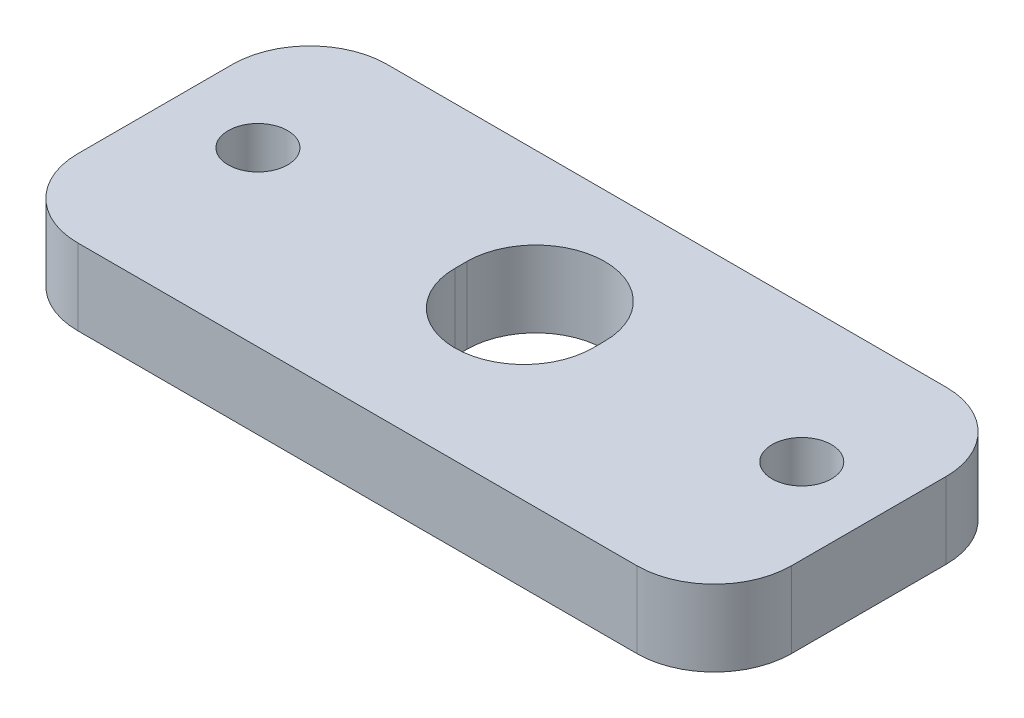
from build123d import *

# Parameters (mm, degrees)
SKETCH1_W             = 29.5
SKETCH1_H             = 12.5
BOSS_EXTRUDE1_DEPTH   = 3.2
M5_CLEARANCE_HOLE1_D  = 5.8
CUT_EXTRUDE1_DEPTH    = 17.336003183
SKETCH5_W             = 30
SKETCH5_H             = 13
SKETCH5_W_2           = 29.5
SKETCH5_H_2           = 12.5
BOSS_EXTRUDE2_DEPTH   = 3.2
FILLET1_R             = 3.25
M3X0_5_TAPPED_HOLE1_D = 2.5


with BuildPart() as part:
    # Sketch1 → Boss-Extrude1 (new body)
    with BuildSketch(Plane(origin=(0, 0, 0), x_dir=(1, 0, 0), z_dir=(0, 1, 0))):
        Rectangle(SKETCH1_W, SKETCH1_H)
    extrude(amount=BOSS_EXTRUDE1_DEPTH)

    # M5 Clearance Hole1 (through all)
    with Locations(Plane(origin=(0, 3.2, 0), x_dir=(1, 0, 0), z_dir=(0, 1, 0))):
        with Locations((0, 0.75)):
            Hole(M5_CLEARANCE_HOLE1_D / 2)

    # Sketch4 → Cut-Extrude1 (cut, through all)
    with BuildSketch(Plane(origin=(0, 3.2, 0), x_dir=(1, 0, 0), z_dir=(0, 1, 0))):
        with BuildLine():
            Line((-2.9, 0.5), (-2.9, 1))
            ThreePointArc((-2.9, 1), (0, 3.9), (2.9, 1))
            Line((2.9, 1), (2.9, 0.5))
            ThreePointArc((2.9, 0.5), (0, -2.4), (-2.9, 0.5))
        make_face()
    extrude(amount=-CUT_EXTRUDE1_DEPTH, mode=Mode.SUBTRACT)

    # Sketch5 → Boss-Extrude2 (add)
    with BuildSketch(Plane(origin=(0, 3.2, 0), x_dir=(1, 0, 0), z_dir=(0, 1, 0))):
        Rectangle(SKETCH5_W, SKETCH5_H)
        Rectangle(SKETCH5_W_2, SKETCH5_H_2, mode=Mode.SUBTRACT)
    extrude(amount=-BOSS_EXTRUDE2_DEPTH)

    # Fillet1
    fillet1_edges = [part.edges().sort_by_distance(p)[0] for p in [
        (-15, 1.6, -6.5),
        (-15, 1.6, 6.5),
        (15, 1.6, 6.5),
        (15, 1.6, -6.5),
    ]]
    fillet(fillet1_edges, radius=FILLET1_R)

    # M3x0.5 Tapped Hole1 (through all)
    with Locations(Plane(origin=(0, 3.2, 0), x_dir=(1, 0, 0), z_dir=(0, 1, 0))):
        with Locations((-11.43, 0.75), (11.43, 0.75)):
            Hole(M3X0_5_TAPPED_HOLE1_D / 2)


solid = part.part
